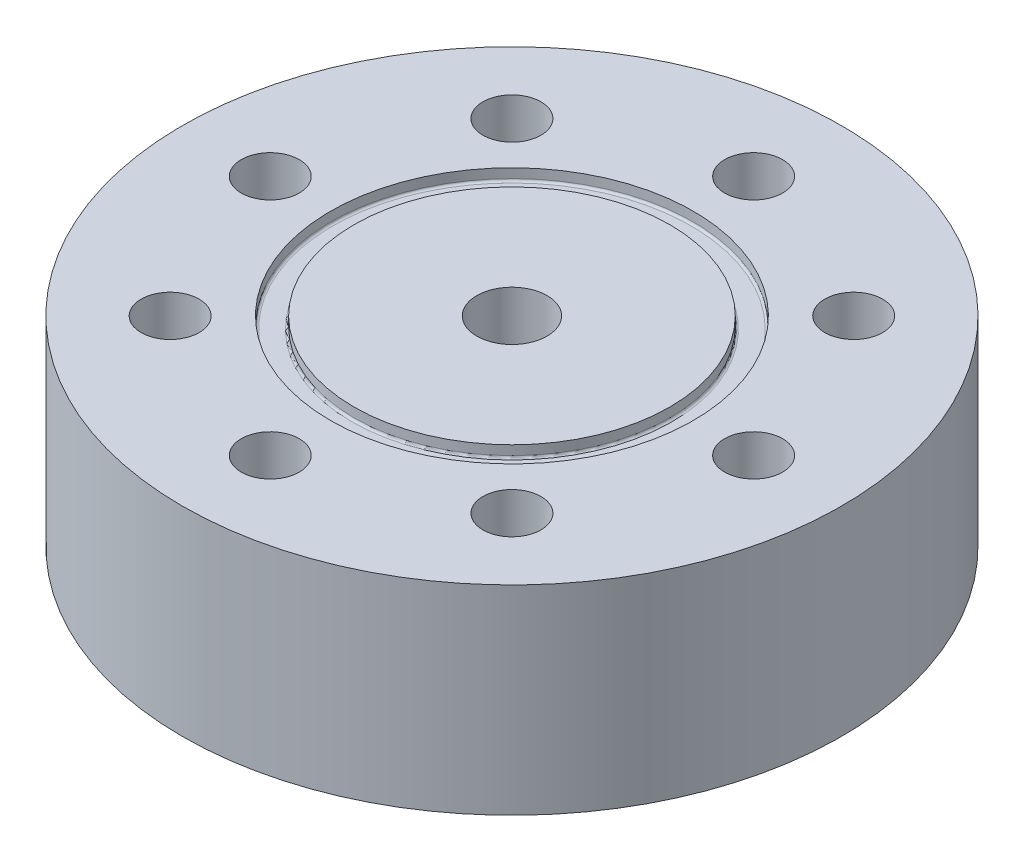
ISO-10303-21;
HEADER;
FILE_DESCRIPTION(('STEP AP214'),'2;1');
FILE_NAME('part.step','',(''),(''),'','','');
FILE_SCHEMA(('AUTOMOTIVE_DESIGN { 1 0 10303 214 1 1 1 1 }'));
ENDSEC;
DATA;
#1=APPLICATION_CONTEXT('core data for automotive mechanical design processes');
#2=APPLICATION_PROTOCOL_DEFINITION('international standard','automotive_design',2000,#1);
#3=PRODUCT_CONTEXT('',#1,'mechanical');
#4=PRODUCT('Part','Part','',(#3));
#5=PRODUCT_RELATED_PRODUCT_CATEGORY('part','',(#4));
#6=PRODUCT_DEFINITION_FORMATION('','',#4);
#7=PRODUCT_DEFINITION_CONTEXT('part definition',#1,'design');
#8=PRODUCT_DEFINITION('design','',#6,#7);
#9=PRODUCT_DEFINITION_SHAPE('','',#8);
#10=(LENGTH_UNIT() NAMED_UNIT(*) SI_UNIT(.MILLI.,.METRE.));
#11=(NAMED_UNIT(*) PLANE_ANGLE_UNIT() SI_UNIT($,.RADIAN.));
#12=(NAMED_UNIT(*) SI_UNIT($,.STERADIAN.) SOLID_ANGLE_UNIT());
#13=UNCERTAINTY_MEASURE_WITH_UNIT(LENGTH_MEASURE(1.E-05),#10,'distance_accuracy_value','');
#14=(GEOMETRIC_REPRESENTATION_CONTEXT(3) GLOBAL_UNCERTAINTY_ASSIGNED_CONTEXT((#13)) GLOBAL_UNIT_ASSIGNED_CONTEXT((#10,
#11,#12)) REPRESENTATION_CONTEXT('',''));
#15=CARTESIAN_POINT('',(0.,0.,0.));
#16=DIRECTION('',(0.,0.,1.));
#17=DIRECTION('',(1.,0.,0.));
#18=AXIS2_PLACEMENT_3D('',#15,#16,#17);
#19=CARTESIAN_POINT('',(0.,22.7,0.));
#20=DIRECTION('',(0.,-1.,0.));
#21=DIRECTION('',(0.,0.,-1.));
#22=AXIS2_PLACEMENT_3D('',#19,#20,#21);
#23=CYLINDRICAL_SURFACE('',#22,37.5);
#24=CARTESIAN_POINT('',(0.,22.7,0.));
#25=DIRECTION('',(0.,1.,0.));
#26=DIRECTION('',(0.,0.,1.));
#27=AXIS2_PLACEMENT_3D('',#24,#25,#26);
#28=CIRCLE('',#27,37.5);
#29=CARTESIAN_POINT('',(0.,22.7,37.5));
#30=VERTEX_POINT('',#29);
#31=EDGE_CURVE('E60',#30,#30,#28,.T.);
#32=ORIENTED_EDGE('',*,*,#31,.F.);
#33=EDGE_LOOP('',(#32));
#34=FACE_BOUND('',#33,.T.);
#35=CARTESIAN_POINT('',(0.,0.,0.));
#36=DIRECTION('',(0.,1.,0.));
#37=DIRECTION('',(0.,0.,1.));
#38=AXIS2_PLACEMENT_3D('',#35,#36,#37);
#39=CIRCLE('',#38,37.5);
#40=CARTESIAN_POINT('',(0.,0.,37.5));
#41=VERTEX_POINT('',#40);
#42=EDGE_CURVE('E61',#41,#41,#39,.T.);
#43=ORIENTED_EDGE('',*,*,#42,.T.);
#44=EDGE_LOOP('',(#43));
#45=FACE_BOUND('',#44,.T.);
#46=ADVANCED_FACE('F36',(#34,#45),#23,.T.);
#47=CARTESIAN_POINT('',(0.,22.7,0.));
#48=DIRECTION('',(0.,1.,0.));
#49=DIRECTION('',(0.,0.,1.));
#50=AXIS2_PLACEMENT_3D('',#47,#48,#49);
#51=PLANE('',#50);
#52=CARTESIAN_POINT('',(0.,22.7,0.));
#53=DIRECTION('',(0.,1.,0.));
#54=DIRECTION('',(0.,0.,1.));
#55=AXIS2_PLACEMENT_3D('',#52,#53,#54);
#56=CIRCLE('',#55,20.6375);
#57=CARTESIAN_POINT('',(0.,22.7,20.6375));
#58=VERTEX_POINT('',#57);
#59=EDGE_CURVE('E82',#58,#58,#56,.T.);
#60=ORIENTED_EDGE('',*,*,#59,.F.);
#61=EDGE_LOOP('',(#60));
#62=FACE_BOUND('',#61,.T.);
#63=CARTESIAN_POINT('',(-27.5,22.7,0.));
#64=DIRECTION('',(0.,-1.,0.));
#65=DIRECTION('',(0.,0.,-1.));
#66=AXIS2_PLACEMENT_3D('',#63,#64,#65);
#67=CIRCLE('',#66,3.3);
#68=CARTESIAN_POINT('',(-27.5,22.7,-3.3));
#69=VERTEX_POINT('',#68);
#70=EDGE_CURVE('E73',#69,#69,#67,.T.);
#71=ORIENTED_EDGE('',*,*,#70,.T.);
#72=EDGE_LOOP('',(#71));
#73=FACE_BOUND('',#72,.T.);
#74=CARTESIAN_POINT('',(-19.44543648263,22.7,19.4454364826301));
#75=DIRECTION('',(0.,-1.,0.));
#76=DIRECTION('',(0.,0.,-1.));
#77=AXIS2_PLACEMENT_3D('',#74,#75,#76);
#78=CIRCLE('',#77,3.30000000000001);
#79=CARTESIAN_POINT('',(-19.44543648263,22.7,16.1454364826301));
#80=VERTEX_POINT('',#79);
#81=EDGE_CURVE('E130',#80,#80,#78,.T.);
#82=ORIENTED_EDGE('',*,*,#81,.T.);
#83=EDGE_LOOP('',(#82));
#84=FACE_BOUND('',#83,.T.);
#85=CARTESIAN_POINT('',(0.,22.7,27.5));
#86=DIRECTION('',(0.,-1.,0.));
#87=DIRECTION('',(0.,0.,-1.));
#88=AXIS2_PLACEMENT_3D('',#85,#86,#87);
#89=CIRCLE('',#88,3.3);
#90=CARTESIAN_POINT('',(0.,22.7,24.2));
#91=VERTEX_POINT('',#90);
#92=EDGE_CURVE('E122',#91,#91,#89,.T.);
#93=ORIENTED_EDGE('',*,*,#92,.T.);
#94=EDGE_LOOP('',(#93));
#95=FACE_BOUND('',#94,.T.);
#96=CARTESIAN_POINT('',(19.4454364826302,22.7,19.44543648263));
#97=DIRECTION('',(0.,-1.,0.));
#98=DIRECTION('',(0.,0.,-1.));
#99=AXIS2_PLACEMENT_3D('',#96,#97,#98);
#100=CIRCLE('',#99,3.3);
#101=CARTESIAN_POINT('',(19.4454364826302,22.7,16.14543648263));
#102=VERTEX_POINT('',#101);
#103=EDGE_CURVE('E114',#102,#102,#100,.T.);
#104=ORIENTED_EDGE('',*,*,#103,.T.);
#105=EDGE_LOOP('',(#104));
#106=FACE_BOUND('',#105,.T.);
#107=CARTESIAN_POINT('',(27.5,22.7,-1.92031473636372E-13));
#108=DIRECTION('',(0.,-1.,0.));
#109=DIRECTION('',(0.,0.,-1.));
#110=AXIS2_PLACEMENT_3D('',#107,#108,#109);
#111=CIRCLE('',#110,3.3);
#112=CARTESIAN_POINT('',(27.5,22.7,-3.30000000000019));
#113=VERTEX_POINT('',#112);
#114=EDGE_CURVE('E106',#113,#113,#111,.T.);
#115=ORIENTED_EDGE('',*,*,#114,.T.);
#116=EDGE_LOOP('',(#115));
#117=FACE_BOUND('',#116,.T.);
#118=CARTESIAN_POINT('',(19.4454364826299,22.7,-19.4454364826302));
#119=DIRECTION('',(0.,-1.,0.));
#120=DIRECTION('',(0.,0.,-1.));
#121=AXIS2_PLACEMENT_3D('',#118,#119,#120);
#122=CIRCLE('',#121,3.3);
#123=CARTESIAN_POINT('',(19.4454364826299,22.7,-22.7454364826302));
#124=VERTEX_POINT('',#123);
#125=EDGE_CURVE('E98',#124,#124,#122,.T.);
#126=ORIENTED_EDGE('',*,*,#125,.T.);
#127=EDGE_LOOP('',(#126));
#128=FACE_BOUND('',#127,.T.);
#129=CARTESIAN_POINT('',(-2.88047210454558E-13,22.7,-27.5));
#130=DIRECTION('',(0.,-1.,0.));
#131=DIRECTION('',(0.,0.,-1.));
#132=AXIS2_PLACEMENT_3D('',#129,#130,#131);
#133=CIRCLE('',#132,3.3);
#134=CARTESIAN_POINT('',(-2.88047210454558E-13,22.7,-30.8));
#135=VERTEX_POINT('',#134);
#136=EDGE_CURVE('E90',#135,#135,#133,.T.);
#137=ORIENTED_EDGE('',*,*,#136,.T.);
#138=EDGE_LOOP('',(#137));
#139=FACE_BOUND('',#138,.T.);
#140=CARTESIAN_POINT('',(-19.4454364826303,22.7,-19.4454364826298));
#141=DIRECTION('',(0.,-1.,0.));
#142=DIRECTION('',(0.,0.,-1.));
#143=AXIS2_PLACEMENT_3D('',#140,#141,#142);
#144=CIRCLE('',#143,3.3);
#145=CARTESIAN_POINT('',(-19.4454364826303,22.7,-22.7454364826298));
#146=VERTEX_POINT('',#145);
#147=EDGE_CURVE('E81',#146,#146,#144,.T.);
#148=ORIENTED_EDGE('',*,*,#147,.T.);
#149=EDGE_LOOP('',(#148));
#150=FACE_BOUND('',#149,.T.);
#151=ORIENTED_EDGE('',*,*,#31,.T.);
#152=EDGE_LOOP('',(#151));
#153=FACE_BOUND('',#152,.T.);
#154=ADVANCED_FACE('F172',(#62,#73,#84,#95,#106,#117,#128,#139,#150,#153),#51,.T.);
#155=CARTESIAN_POINT('',(0.,0.,0.));
#156=DIRECTION('',(0.,1.,0.));
#157=DIRECTION('',(0.,0.,1.));
#158=AXIS2_PLACEMENT_3D('',#155,#156,#157);
#159=PLANE('',#158);
#160=CARTESIAN_POINT('',(-27.5,0.,0.));
#161=DIRECTION('',(0.,-1.,0.));
#162=DIRECTION('',(0.,0.,-1.));
#163=AXIS2_PLACEMENT_3D('',#160,#161,#162);
#164=CIRCLE('',#163,3.3);
#165=CARTESIAN_POINT('',(-27.5,0.,-3.3));
#166=VERTEX_POINT('',#165);
#167=EDGE_CURVE('E134',#166,#166,#164,.T.);
#168=ORIENTED_EDGE('',*,*,#167,.F.);
#169=EDGE_LOOP('',(#168));
#170=FACE_BOUND('',#169,.T.);
#171=CARTESIAN_POINT('',(-19.44543648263,0.,19.4454364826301));
#172=DIRECTION('',(0.,-1.,0.));
#173=DIRECTION('',(0.,0.,-1.));
#174=AXIS2_PLACEMENT_3D('',#171,#172,#173);
#175=CIRCLE('',#174,3.30000000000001);
#176=CARTESIAN_POINT('',(-19.44543648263,0.,16.1454364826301));
#177=VERTEX_POINT('',#176);
#178=EDGE_CURVE('E126',#177,#177,#175,.T.);
#179=ORIENTED_EDGE('',*,*,#178,.F.);
#180=EDGE_LOOP('',(#179));
#181=FACE_BOUND('',#180,.T.);
#182=CARTESIAN_POINT('',(0.,0.,27.5));
#183=DIRECTION('',(0.,-1.,0.));
#184=DIRECTION('',(0.,0.,-1.));
#185=AXIS2_PLACEMENT_3D('',#182,#183,#184);
#186=CIRCLE('',#185,3.3);
#187=CARTESIAN_POINT('',(0.,0.,24.2));
#188=VERTEX_POINT('',#187);
#189=EDGE_CURVE('E118',#188,#188,#186,.T.);
#190=ORIENTED_EDGE('',*,*,#189,.F.);
#191=EDGE_LOOP('',(#190));
#192=FACE_BOUND('',#191,.T.);
#193=CARTESIAN_POINT('',(19.4454364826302,0.,19.44543648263));
#194=DIRECTION('',(0.,-1.,0.));
#195=DIRECTION('',(0.,0.,-1.));
#196=AXIS2_PLACEMENT_3D('',#193,#194,#195);
#197=CIRCLE('',#196,3.3);
#198=CARTESIAN_POINT('',(19.4454364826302,0.,16.14543648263));
#199=VERTEX_POINT('',#198);
#200=EDGE_CURVE('E110',#199,#199,#197,.T.);
#201=ORIENTED_EDGE('',*,*,#200,.F.);
#202=EDGE_LOOP('',(#201));
#203=FACE_BOUND('',#202,.T.);
#204=CARTESIAN_POINT('',(27.5,0.,-1.92031473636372E-13));
#205=DIRECTION('',(0.,-1.,0.));
#206=DIRECTION('',(0.,0.,-1.));
#207=AXIS2_PLACEMENT_3D('',#204,#205,#206);
#208=CIRCLE('',#207,3.3);
#209=CARTESIAN_POINT('',(27.5,0.,-3.30000000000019));
#210=VERTEX_POINT('',#209);
#211=EDGE_CURVE('E102',#210,#210,#208,.T.);
#212=ORIENTED_EDGE('',*,*,#211,.F.);
#213=EDGE_LOOP('',(#212));
#214=FACE_BOUND('',#213,.T.);
#215=CARTESIAN_POINT('',(19.4454364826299,0.,-19.4454364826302));
#216=DIRECTION('',(0.,-1.,0.));
#217=DIRECTION('',(0.,0.,-1.));
#218=AXIS2_PLACEMENT_3D('',#215,#216,#217);
#219=CIRCLE('',#218,3.3);
#220=CARTESIAN_POINT('',(19.4454364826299,0.,-22.7454364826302));
#221=VERTEX_POINT('',#220);
#222=EDGE_CURVE('E94',#221,#221,#219,.T.);
#223=ORIENTED_EDGE('',*,*,#222,.F.);
#224=EDGE_LOOP('',(#223));
#225=FACE_BOUND('',#224,.T.);
#226=CARTESIAN_POINT('',(-2.88047210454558E-13,0.,-27.5));
#227=DIRECTION('',(0.,-1.,0.));
#228=DIRECTION('',(0.,0.,-1.));
#229=AXIS2_PLACEMENT_3D('',#226,#227,#228);
#230=CIRCLE('',#229,3.3);
#231=CARTESIAN_POINT('',(-2.88047210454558E-13,0.,-30.8));
#232=VERTEX_POINT('',#231);
#233=EDGE_CURVE('E86',#232,#232,#230,.T.);
#234=ORIENTED_EDGE('',*,*,#233,.F.);
#235=EDGE_LOOP('',(#234));
#236=FACE_BOUND('',#235,.T.);
#237=CARTESIAN_POINT('',(-19.4454364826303,0.,-19.4454364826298));
#238=DIRECTION('',(0.,-1.,0.));
#239=DIRECTION('',(0.,0.,-1.));
#240=AXIS2_PLACEMENT_3D('',#237,#238,#239);
#241=CIRCLE('',#240,3.3);
#242=CARTESIAN_POINT('',(-19.4454364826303,0.,-22.7454364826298));
#243=VERTEX_POINT('',#242);
#244=EDGE_CURVE('E77',#243,#243,#241,.T.);
#245=ORIENTED_EDGE('',*,*,#244,.F.);
#246=EDGE_LOOP('',(#245));
#247=FACE_BOUND('',#246,.T.);
#248=CARTESIAN_POINT('',(0.,0.,0.));
#249=DIRECTION('',(0.,-1.,0.));
#250=DIRECTION('',(0.,0.,-1.));
#251=AXIS2_PLACEMENT_3D('',#248,#249,#250);
#252=CIRCLE('',#251,8.93);
#253=CARTESIAN_POINT('',(0.,0.,-8.93));
#254=VERTEX_POINT('',#253);
#255=EDGE_CURVE('E69',#254,#254,#252,.T.);
#256=ORIENTED_EDGE('',*,*,#255,.F.);
#257=EDGE_LOOP('',(#256));
#258=FACE_BOUND('',#257,.T.);
#259=ORIENTED_EDGE('',*,*,#42,.F.);
#260=EDGE_LOOP('',(#259));
#261=FACE_BOUND('',#260,.T.);
#262=ADVANCED_FACE('F192',(#170,#181,#192,#203,#214,#225,#236,#247,#258,#261),#159,.F.);
#263=CARTESIAN_POINT('',(0.,12.7,0.));
#264=DIRECTION('',(0.,-1.,0.));
#265=DIRECTION('',(0.,0.,-1.));
#266=AXIS2_PLACEMENT_3D('',#263,#264,#265);
#267=CYLINDRICAL_SURFACE('',#266,8.93);
#268=CARTESIAN_POINT('',(0.,12.7,0.));
#269=DIRECTION('',(0.,-1.,0.));
#270=DIRECTION('',(0.,0.,-1.));
#271=AXIS2_PLACEMENT_3D('',#268,#269,#270);
#272=CIRCLE('',#271,8.93);
#273=CARTESIAN_POINT('',(0.,12.7,-8.93));
#274=VERTEX_POINT('',#273);
#275=EDGE_CURVE('E65',#274,#274,#272,.T.);
#276=ORIENTED_EDGE('',*,*,#275,.F.);
#277=EDGE_LOOP('',(#276));
#278=FACE_BOUND('',#277,.T.);
#279=ORIENTED_EDGE('',*,*,#255,.T.);
#280=EDGE_LOOP('',(#279));
#281=FACE_BOUND('',#280,.T.);
#282=ADVANCED_FACE('F228',(#278,#281),#267,.F.);
#283=CARTESIAN_POINT('',(0.,12.7,0.));
#284=DIRECTION('',(0.,-1.,0.));
#285=DIRECTION('',(0.,0.,-1.));
#286=AXIS2_PLACEMENT_3D('',#283,#284,#285);
#287=PLANE('',#286);
#288=CARTESIAN_POINT('',(0.,12.7,0.));
#289=DIRECTION('',(0.,1.,0.));
#290=DIRECTION('',(0.,0.,1.));
#291=AXIS2_PLACEMENT_3D('',#288,#289,#290);
#292=CIRCLE('',#291,4.);
#293=CARTESIAN_POINT('',(0.,12.7,4.));
#294=VERTEX_POINT('',#293);
#295=EDGE_CURVE('E148',#294,#294,#292,.T.);
#296=ORIENTED_EDGE('',*,*,#295,.T.);
#297=EDGE_LOOP('',(#296));
#298=FACE_BOUND('',#297,.T.);
#299=ORIENTED_EDGE('',*,*,#275,.T.);
#300=EDGE_LOOP('',(#299));
#301=FACE_BOUND('',#300,.T.);
#302=ADVANCED_FACE('F157',(#298,#301),#287,.T.);
#303=CARTESIAN_POINT('',(-19.4454364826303,22.7,-19.4454364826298));
#304=DIRECTION('',(0.,-1.,0.));
#305=DIRECTION('',(0.,0.,-1.));
#306=AXIS2_PLACEMENT_3D('',#303,#304,#305);
#307=CYLINDRICAL_SURFACE('',#306,3.3);
#308=ORIENTED_EDGE('',*,*,#147,.F.);
#309=EDGE_LOOP('',(#308));
#310=FACE_BOUND('',#309,.T.);
#311=ORIENTED_EDGE('',*,*,#244,.T.);
#312=EDGE_LOOP('',(#311));
#313=FACE_BOUND('',#312,.T.);
#314=ADVANCED_FACE('F227',(#310,#313),#307,.F.);
#315=CARTESIAN_POINT('',(-2.88047210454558E-13,22.7,-27.5));
#316=DIRECTION('',(0.,-1.,0.));
#317=DIRECTION('',(0.,0.,-1.));
#318=AXIS2_PLACEMENT_3D('',#315,#316,#317);
#319=CYLINDRICAL_SURFACE('',#318,3.3);
#320=ORIENTED_EDGE('',*,*,#136,.F.);
#321=EDGE_LOOP('',(#320));
#322=FACE_BOUND('',#321,.T.);
#323=ORIENTED_EDGE('',*,*,#233,.T.);
#324=EDGE_LOOP('',(#323));
#325=FACE_BOUND('',#324,.T.);
#326=ADVANCED_FACE('F244',(#322,#325),#319,.F.);
#327=CARTESIAN_POINT('',(19.4454364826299,22.7,-19.4454364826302));
#328=DIRECTION('',(0.,-1.,0.));
#329=DIRECTION('',(0.,0.,-1.));
#330=AXIS2_PLACEMENT_3D('',#327,#328,#329);
#331=CYLINDRICAL_SURFACE('',#330,3.3);
#332=ORIENTED_EDGE('',*,*,#125,.F.);
#333=EDGE_LOOP('',(#332));
#334=FACE_BOUND('',#333,.T.);
#335=ORIENTED_EDGE('',*,*,#222,.T.);
#336=EDGE_LOOP('',(#335));
#337=FACE_BOUND('',#336,.T.);
#338=ADVANCED_FACE('F252',(#334,#337),#331,.F.);
#339=CARTESIAN_POINT('',(27.5,22.7,-1.92031473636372E-13));
#340=DIRECTION('',(0.,-1.,0.));
#341=DIRECTION('',(0.,0.,-1.));
#342=AXIS2_PLACEMENT_3D('',#339,#340,#341);
#343=CYLINDRICAL_SURFACE('',#342,3.3);
#344=ORIENTED_EDGE('',*,*,#114,.F.);
#345=EDGE_LOOP('',(#344));
#346=FACE_BOUND('',#345,.T.);
#347=ORIENTED_EDGE('',*,*,#211,.T.);
#348=EDGE_LOOP('',(#347));
#349=FACE_BOUND('',#348,.T.);
#350=ADVANCED_FACE('F260',(#346,#349),#343,.F.);
#351=CARTESIAN_POINT('',(19.4454364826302,22.7,19.44543648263));
#352=DIRECTION('',(0.,-1.,0.));
#353=DIRECTION('',(0.,0.,-1.));
#354=AXIS2_PLACEMENT_3D('',#351,#352,#353);
#355=CYLINDRICAL_SURFACE('',#354,3.3);
#356=ORIENTED_EDGE('',*,*,#103,.F.);
#357=EDGE_LOOP('',(#356));
#358=FACE_BOUND('',#357,.T.);
#359=ORIENTED_EDGE('',*,*,#200,.T.);
#360=EDGE_LOOP('',(#359));
#361=FACE_BOUND('',#360,.T.);
#362=ADVANCED_FACE('F268',(#358,#361),#355,.F.);
#363=CARTESIAN_POINT('',(0.,22.7,27.5));
#364=DIRECTION('',(0.,-1.,0.));
#365=DIRECTION('',(0.,0.,-1.));
#366=AXIS2_PLACEMENT_3D('',#363,#364,#365);
#367=CYLINDRICAL_SURFACE('',#366,3.3);
#368=ORIENTED_EDGE('',*,*,#92,.F.);
#369=EDGE_LOOP('',(#368));
#370=FACE_BOUND('',#369,.T.);
#371=ORIENTED_EDGE('',*,*,#189,.T.);
#372=EDGE_LOOP('',(#371));
#373=FACE_BOUND('',#372,.T.);
#374=ADVANCED_FACE('F276',(#370,#373),#367,.F.);
#375=CARTESIAN_POINT('',(-19.44543648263,22.7,19.4454364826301));
#376=DIRECTION('',(0.,-1.,0.));
#377=DIRECTION('',(0.,0.,-1.));
#378=AXIS2_PLACEMENT_3D('',#375,#376,#377);
#379=CYLINDRICAL_SURFACE('',#378,3.30000000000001);
#380=ORIENTED_EDGE('',*,*,#81,.F.);
#381=EDGE_LOOP('',(#380));
#382=FACE_BOUND('',#381,.T.);
#383=ORIENTED_EDGE('',*,*,#178,.T.);
#384=EDGE_LOOP('',(#383));
#385=FACE_BOUND('',#384,.T.);
#386=ADVANCED_FACE('F284',(#382,#385),#379,.F.);
#387=CARTESIAN_POINT('',(-27.5,22.7,0.));
#388=DIRECTION('',(0.,-1.,0.));
#389=DIRECTION('',(0.,0.,-1.));
#390=AXIS2_PLACEMENT_3D('',#387,#388,#389);
#391=CYLINDRICAL_SURFACE('',#390,3.3);
#392=ORIENTED_EDGE('',*,*,#70,.F.);
#393=EDGE_LOOP('',(#392));
#394=FACE_BOUND('',#393,.T.);
#395=ORIENTED_EDGE('',*,*,#167,.T.);
#396=EDGE_LOOP('',(#395));
#397=FACE_BOUND('',#396,.T.);
#398=ADVANCED_FACE('F292',(#394,#397),#391,.F.);
#399=CARTESIAN_POINT('',(0.,21.3792,0.));
#400=DIRECTION('',(0.,1.,0.));
#401=DIRECTION('',(0.,0.,1.));
#402=AXIS2_PLACEMENT_3D('',#399,#400,#401);
#403=CYLINDRICAL_SURFACE('',#402,20.6375);
#404=CARTESIAN_POINT('',(0.,21.6332,0.));
#405=DIRECTION('',(0.,1.,0.));
#406=DIRECTION('',(0.,0.,1.));
#407=AXIS2_PLACEMENT_3D('',#404,#405,#406);
#408=CIRCLE('',#407,20.6375);
#409=CARTESIAN_POINT('',(0.,21.6332,20.6375));
#410=VERTEX_POINT('',#409);
#411=EDGE_CURVE('E10',#410,#410,#408,.F.);
#412=ORIENTED_EDGE('',*,*,#411,.T.);
#413=EDGE_LOOP('',(#412));
#414=FACE_BOUND('',#413,.T.);
#415=ORIENTED_EDGE('',*,*,#59,.T.);
#416=EDGE_LOOP('',(#415));
#417=FACE_BOUND('',#416,.T.);
#418=ADVANCED_FACE('F183',(#414,#417),#403,.F.);
#419=CARTESIAN_POINT('',(0.,21.3792,0.));
#420=DIRECTION('',(0.,1.,0.));
#421=DIRECTION('',(0.,0.,1.));
#422=AXIS2_PLACEMENT_3D('',#419,#420,#421);
#423=PLANE('',#422);
#424=CARTESIAN_POINT('',(0.,21.3792,0.));
#425=DIRECTION('',(0.,1.,0.));
#426=DIRECTION('',(0.,0.,1.));
#427=AXIS2_PLACEMENT_3D('',#424,#425,#426);
#428=CIRCLE('',#427,18.2245);
#429=CARTESIAN_POINT('',(0.,21.3792,18.2245));
#430=VERTEX_POINT('',#429);
#431=EDGE_CURVE('E44',#430,#430,#428,.F.);
#432=ORIENTED_EDGE('',*,*,#431,.T.);
#433=EDGE_LOOP('',(#432));
#434=FACE_BOUND('',#433,.T.);
#435=CARTESIAN_POINT('',(0.,21.3792,0.));
#436=DIRECTION('',(0.,1.,0.));
#437=DIRECTION('',(0.,0.,1.));
#438=AXIS2_PLACEMENT_3D('',#435,#436,#437);
#439=CIRCLE('',#438,20.3835);
#440=CARTESIAN_POINT('',(0.,21.3792,20.3835));
#441=VERTEX_POINT('',#440);
#442=EDGE_CURVE('E49',#441,#441,#439,.T.);
#443=ORIENTED_EDGE('',*,*,#442,.T.);
#444=EDGE_LOOP('',(#443));
#445=FACE_BOUND('',#444,.T.);
#446=ADVANCED_FACE('F176',(#434,#445),#423,.T.);
#447=CARTESIAN_POINT('',(0.,21.3792,0.));
#448=DIRECTION('',(0.,1.,0.));
#449=DIRECTION('',(0.,0.,1.));
#450=AXIS2_PLACEMENT_3D('',#447,#448,#449);
#451=CYLINDRICAL_SURFACE('',#450,17.9705);
#452=CARTESIAN_POINT('',(0.,21.6332,0.));
#453=DIRECTION('',(0.,1.,0.));
#454=DIRECTION('',(0.,0.,1.));
#455=AXIS2_PLACEMENT_3D('',#452,#453,#454);
#456=CIRCLE('',#455,17.9705);
#457=CARTESIAN_POINT('',(0.,21.6332,17.9705));
#458=VERTEX_POINT('',#457);
#459=EDGE_CURVE('E54',#458,#458,#456,.T.);
#460=ORIENTED_EDGE('',*,*,#459,.T.);
#461=EDGE_LOOP('',(#460));
#462=FACE_BOUND('',#461,.T.);
#463=CARTESIAN_POINT('',(0.,22.7,0.));
#464=DIRECTION('',(0.,1.,0.));
#465=DIRECTION('',(0.,0.,1.));
#466=AXIS2_PLACEMENT_3D('',#463,#464,#465);
#467=CIRCLE('',#466,17.9705);
#468=CARTESIAN_POINT('',(0.,22.7,17.9705));
#469=VERTEX_POINT('',#468);
#470=EDGE_CURVE('E144',#469,#469,#467,.T.);
#471=ORIENTED_EDGE('',*,*,#470,.F.);
#472=EDGE_LOOP('',(#471));
#473=FACE_BOUND('',#472,.T.);
#474=ADVANCED_FACE('F170',(#462,#473),#451,.T.);
#475=CARTESIAN_POINT('',(0.,22.7,0.));
#476=DIRECTION('',(0.,1.,0.));
#477=DIRECTION('',(0.,0.,1.));
#478=AXIS2_PLACEMENT_3D('',#475,#476,#477);
#479=CIRCLE('',#478,4.);
#480=CARTESIAN_POINT('',(0.,22.7,4.));
#481=VERTEX_POINT('',#480);
#482=EDGE_CURVE('E149',#481,#481,#479,.T.);
#483=ORIENTED_EDGE('',*,*,#482,.F.);
#484=EDGE_LOOP('',(#483));
#485=FACE_BOUND('',#484,.T.);
#486=ORIENTED_EDGE('',*,*,#470,.T.);
#487=EDGE_LOOP('',(#486));
#488=FACE_BOUND('',#487,.T.);
#489=ADVANCED_FACE('F166',(#485,#488),#51,.T.);
#490=CARTESIAN_POINT('',(0.,21.6332,0.));
#491=DIRECTION('',(0.,1.,0.));
#492=DIRECTION('',(0.,0.,1.));
#493=AXIS2_PLACEMENT_3D('',#490,#491,#492);
#494=TOROIDAL_SURFACE('',#493,18.2245,0.254);
#495=ORIENTED_EDGE('',*,*,#431,.F.);
#496=EDGE_LOOP('',(#495));
#497=FACE_BOUND('',#496,.T.);
#498=ORIENTED_EDGE('',*,*,#459,.F.);
#499=EDGE_LOOP('',(#498));
#500=FACE_BOUND('',#499,.T.);
#501=ADVANCED_FACE('F169',(#497,#500),#494,.F.);
#502=CARTESIAN_POINT('',(0.,21.6332,0.));
#503=DIRECTION('',(0.,1.,0.));
#504=DIRECTION('',(0.,0.,1.));
#505=AXIS2_PLACEMENT_3D('',#502,#503,#504);
#506=TOROIDAL_SURFACE('',#505,20.3835,0.254);
#507=ORIENTED_EDGE('',*,*,#411,.F.);
#508=EDGE_LOOP('',(#507));
#509=FACE_BOUND('',#508,.T.);
#510=ORIENTED_EDGE('',*,*,#442,.F.);
#511=EDGE_LOOP('',(#510));
#512=FACE_BOUND('',#511,.T.);
#513=ADVANCED_FACE('F38',(#509,#512),#506,.F.);
#514=CARTESIAN_POINT('',(0.,12.7,0.));
#515=DIRECTION('',(0.,1.,0.));
#516=DIRECTION('',(0.,0.,1.));
#517=AXIS2_PLACEMENT_3D('',#514,#515,#516);
#518=CYLINDRICAL_SURFACE('',#517,4.);
#519=ORIENTED_EDGE('',*,*,#295,.F.);
#520=EDGE_LOOP('',(#519));
#521=FACE_BOUND('',#520,.T.);
#522=ORIENTED_EDGE('',*,*,#482,.T.);
#523=EDGE_LOOP('',(#522));
#524=FACE_BOUND('',#523,.T.);
#525=ADVANCED_FACE('F160',(#521,#524),#518,.F.);
#526=CLOSED_SHELL('',(#46,#154,#262,#282,#302,#314,#326,#338,#350,#362,#374,#386,#398,#418,#446,
#474,#489,#501,#513,#525));
#527=MANIFOLD_SOLID_BREP('B2',#526);
#528=ADVANCED_BREP_SHAPE_REPRESENTATION('',(#18,#527),#14);
#529=SHAPE_DEFINITION_REPRESENTATION(#9,#528);
ENDSEC;
END-ISO-10303-21;
